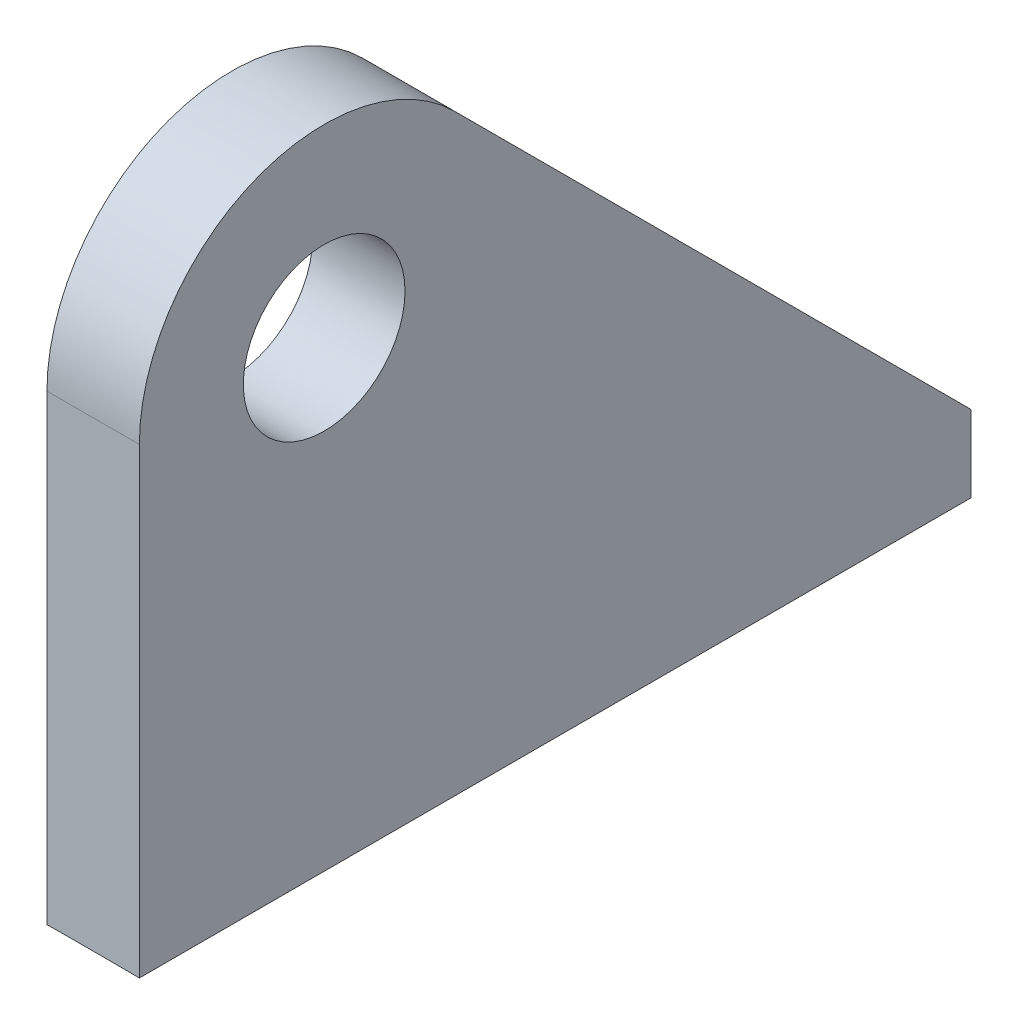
from build123d import *

# Parameters (mm, degrees)
SKETCH2_R           = 22.225
BOSS_EXTRUDE1_DEPTH = 12.7
SKETCH3_R           = 1524
CUT_EXTRUDE1_DEPTH  = 290.882890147


with BuildPart() as part:
    # Sketch2 → Boss-Extrude1 (new, symmetric)
    with BuildSketch(Plane(origin=(0, 0, 0), x_dir=(0, 0, -1), z_dir=(1, 0, 0))):
        with BuildLine():
            Line((0, 127), (0, 0))
            Line((0, 0), (228.6, 0))
            Line((228.6, 0), (228.6, 21.042048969))
            Line((228.6, 21.042048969), (86.721024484, 162.921024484))
            ThreePointArc((86.721024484, 162.921024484), (31.359681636, 173.933080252), (0, 127))
        make_face()
        with Locations((50.8, 127)):
            Circle(SKETCH2_R, mode=Mode.SUBTRACT)
    extrude(amount=BOSS_EXTRUDE1_DEPTH, both=True)

    # Sketch3 → Cut-Extrude1 (cut, through all)
    with BuildSketch(Plane.XY):
        with Locations((0, -1523.947082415)):
            Circle(SKETCH3_R)
    extrude(amount=-CUT_EXTRUDE1_DEPTH, mode=Mode.SUBTRACT)


solid = part.part
